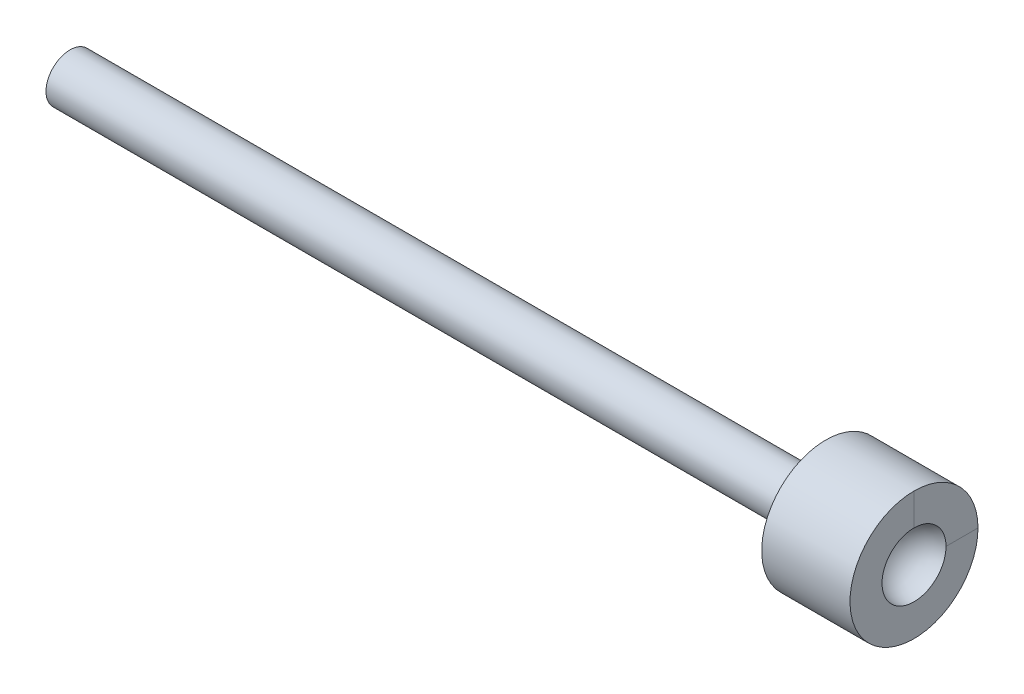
from build123d import *

# Parameters (mm, degrees)
SKETCH1_W      = 299.974
SKETCH1_H      = 9.525
SKETCH2_R      = 25.4
EXTRUDE1_DEPTH = 35.052


with BuildPart() as part:
    # Sketch1 → Revolve1 (revolve)
    with BuildSketch(Plane.XY, mode=Mode.PRIVATE) as revolve1_sk:
        with Locations((0, 4.7625)):
            Rectangle(SKETCH1_W, SKETCH1_H)
    revolve(revolve1_sk.sketch.rotate(Axis((-167.819108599, 0, 0), (1, 0, 0)), 90), axis=Axis((-167.819108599, 0, 0), (1, 0, 0)))

    # Sketch2 → Extrude1 (add)
    with BuildSketch(Plane(origin=(149.987, 0, 0), x_dir=(0, 0, -1), z_dir=(1, 0, 0))):
        Circle(SKETCH2_R)
    extrude(amount=EXTRUDE1_DEPTH)

    # Sketch4 → Cut-Revolve1 (revolve, cut)
    with BuildSketch(Plane.XY):
        with BuildLine():
            Line((172.339, 0), (197.739, 0))
            ThreePointArc((197.739, 0), (185.039, 12.7), (172.339, 0))
        make_face()
    revolve(axis=Axis((133.883686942, 0, 0), (1, 0, 0)), mode=Mode.SUBTRACT)


solid = part.part
